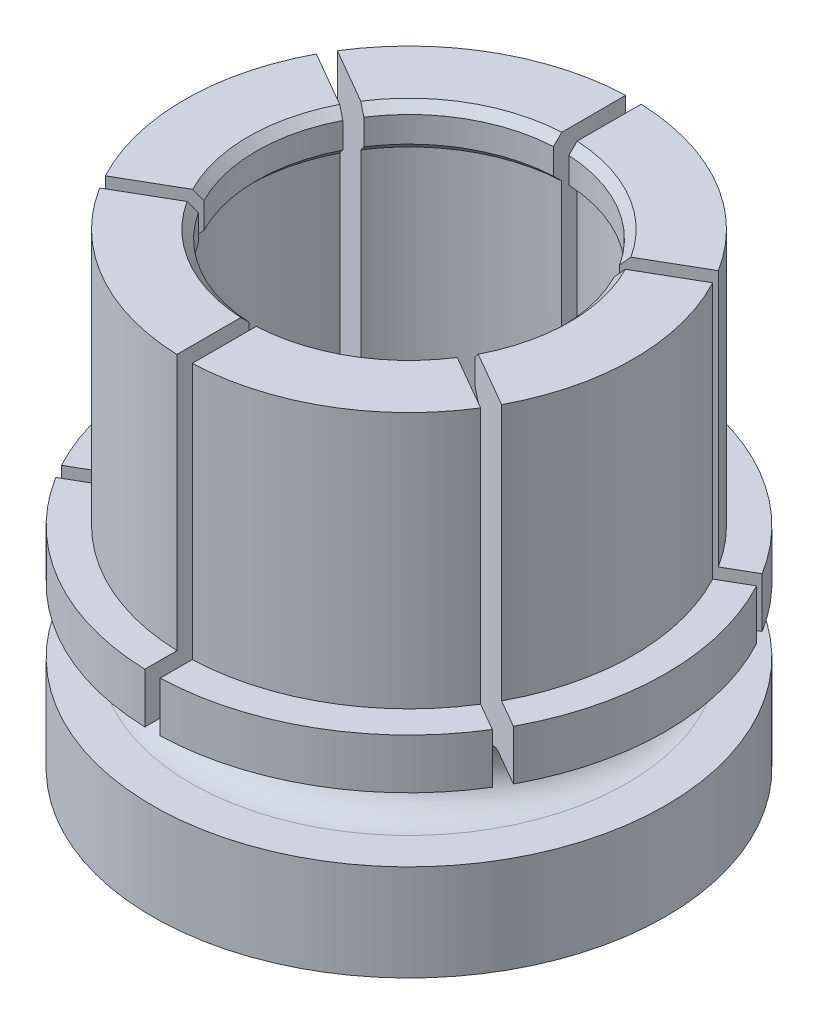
from build123d import *

# Parameters (mm, degrees)
SKETCH2_W          = 0.762
SKETCH2_H          = 20.208759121
CUT_EXTRUDE1_DEPTH = 30.271778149
CIRPATTERN1_COUNT  = 3


with BuildPart() as part:
    # Sketch1 → Revolve1 (revolve)
    with BuildSketch(Plane.XY, mode=Mode.PRIVATE) as revolve1_sk:
        Polygon((7.9502, -2.08788), (7.9502, -23.114), (12.7, -23.114), (12.7, -12.7), (11.1125, -12.7), (11.1125, 0), (7.9502, 0), (7.54126, -0.40894), (7.54126, -1.67894), align=None)
    revolve(revolve1_sk.sketch.rotate(Axis((0, 0, 0), (0, -1, 0)), 180), axis=Axis((0, 0, 0), (0, -1, 0)))

    # Sketch2 → Cut-Extrude1 (cut, symmetric)
    with BuildSketch(Plane.XY):
        with Locations((0, -6.659620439)):
            Rectangle(SKETCH2_W, SKETCH2_H)
    cut_extrude1 = extrude(amount=CUT_EXTRUDE1_DEPTH, both=True, mode=Mode.SUBTRACT)

    # CirPattern1: Cut-Extrude1 ×3 about axis
    cirpattern1_axis = Axis((0, 0, 0), (0, 1, 0))
    for i in range(1, CIRPATTERN1_COUNT):
        add(cut_extrude1.rotate(cirpattern1_axis, i * 360 / CIRPATTERN1_COUNT), mode=Mode.SUBTRACT)

    # Sketch3 → Cut-Revolve1 (revolve, cut)
    with BuildSketch(Plane.XY, mode=Mode.PRIVATE) as cut_revolve1_sk:
        with BuildLine():
            Line((10.795, -15.1765), (12.7, -15.1765))
            ThreePointArc((12.7, -15.1765), (14.2875, -16.764), (12.7, -18.3515))
            Line((12.7, -18.3515), (10.795, -18.3515))
            ThreePointArc((10.795, -18.3515), (9.2075, -16.764), (10.795, -15.1765))
        make_face()
    revolve(cut_revolve1_sk.sketch.rotate(Axis((0, 0, 0), (0, -1, 0)), 180), axis=Axis((0, 0, 0), (0, -1, 0)), mode=Mode.SUBTRACT)


solid = part.part
